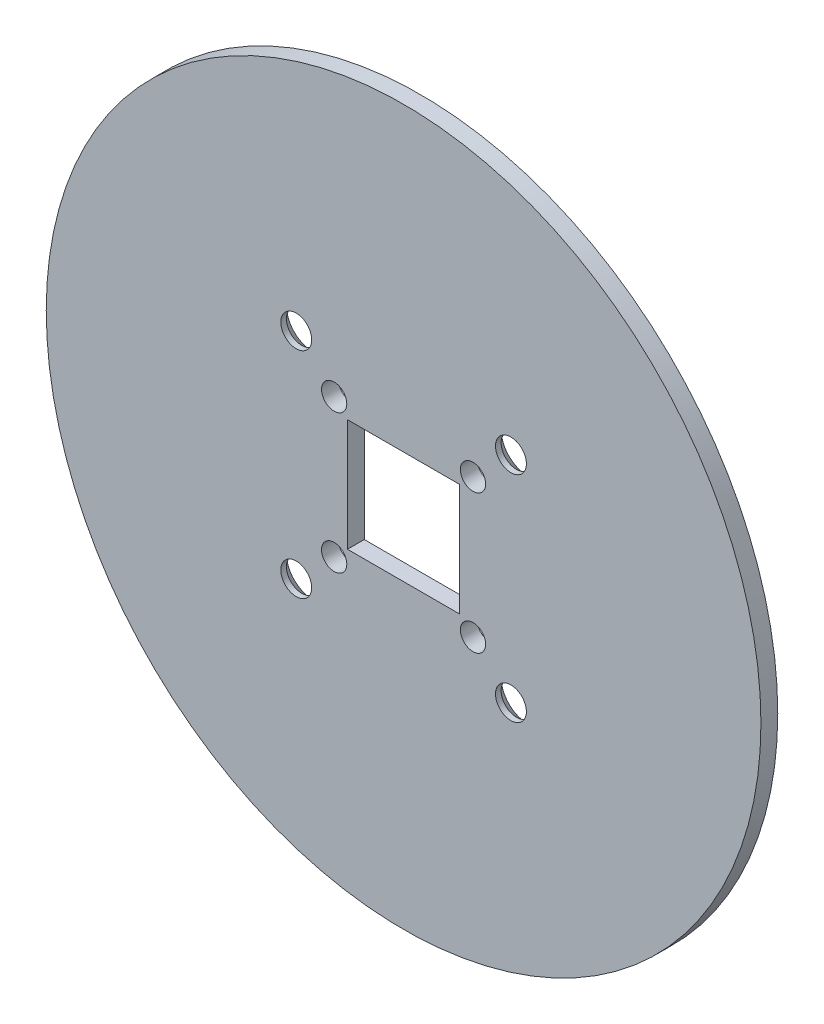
from build123d import *

# Parameters (mm, degrees)
ESQUISSE1_R             = 2.75
ESQUISSE1_W             = 20
ESQUISSE1_H             = 20
BOSS_EXTRU_1_DEPTH      = 3
CHANFREIN1_SIZE         = 2
ESQUISSE3_R             = 2.25
ENL_V_MAT_EXTRU_1_DEPTH = 10
ESQUISSE4_OUTSIDE_W     = 165.424
ESQUISSE4_OUTSIDE_H     = 165.424
ESQUISSE4_OUTSIDE_R     = 63.693976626
ENL_V_MAT_EXTRU_2_DEPTH = 10


with BuildPart() as part:
    # Esquisse1 → Boss.-Extru.1 (new body)
    with BuildSketch(Plane.XY):
        Polygon((-63.693976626, -26.38290896), (-26.38290896, -63.693976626), (26.38290896, -63.693976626), (63.693976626, -26.38290896), (63.693976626, 26.38290896), (26.38290896, 63.693976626), (-26.38290896, 63.693976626), (-63.693976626, 26.38290896), align=None)
        with Locations((19.134171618, 19.134171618)):
            Circle(ESQUISSE1_R, mode=Mode.SUBTRACT)
        with Locations((19.134171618, -19.134171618)):
            Circle(ESQUISSE1_R, mode=Mode.SUBTRACT)
        with Locations(Location((-19.134171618, -19.134171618, 0), (0, 0, 180))):
            Circle(ESQUISSE1_R, mode=Mode.SUBTRACT)
        with Locations(Location((-19.134171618, 19.134171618, 0), (0, 0, 180))):
            Circle(ESQUISSE1_R, mode=Mode.SUBTRACT)
        Rectangle(ESQUISSE1_W, ESQUISSE1_H, mode=Mode.SUBTRACT)
    extrude(amount=BOSS_EXTRU_1_DEPTH)

    # Chanfrein1
    chanfrein1_edges = [part.edges().sort_by_distance(p)[0] for p in [
        (16.384171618, 19.134171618, 0),
        (16.384171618, -19.134171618, 0),
        (-16.384171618, -19.134171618, 0),
        (-16.384171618, 19.134171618, 0),
    ]]
    chamfer(chanfrein1_edges, length=CHANFREIN1_SIZE)

    # Esquisse3 → Enl_v. mat.-Extru.1 (cut)
    with BuildSketch(Plane(origin=(0, 0, 0), x_dir=(-1, 0, 0), z_dir=(0, 0, -1))):
        with Locations((12.374368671, 12.374368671)):
            Circle(ESQUISSE3_R)
        with Locations((12.374368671, -12.374368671)):
            Circle(ESQUISSE3_R)
        with Locations((-12.374368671, 12.374368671)):
            Circle(ESQUISSE3_R)
        with Locations((-12.374368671, -12.374368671)):
            Circle(ESQUISSE3_R)
    extrude(amount=-ENL_V_MAT_EXTRU_1_DEPTH, mode=Mode.SUBTRACT)

    # Esquisse4 outside → Enl_v. mat.-Extru.2 (cut)
    with BuildSketch(Plane(origin=(0, 0, 0), x_dir=(-1, 0, 0), z_dir=(0, 0, -1))):
        Rectangle(ESQUISSE4_OUTSIDE_W, ESQUISSE4_OUTSIDE_H)
        Circle(ESQUISSE4_OUTSIDE_R, mode=Mode.SUBTRACT)
    extrude(amount=-ENL_V_MAT_EXTRU_2_DEPTH, mode=Mode.SUBTRACT)


solid = part.part
